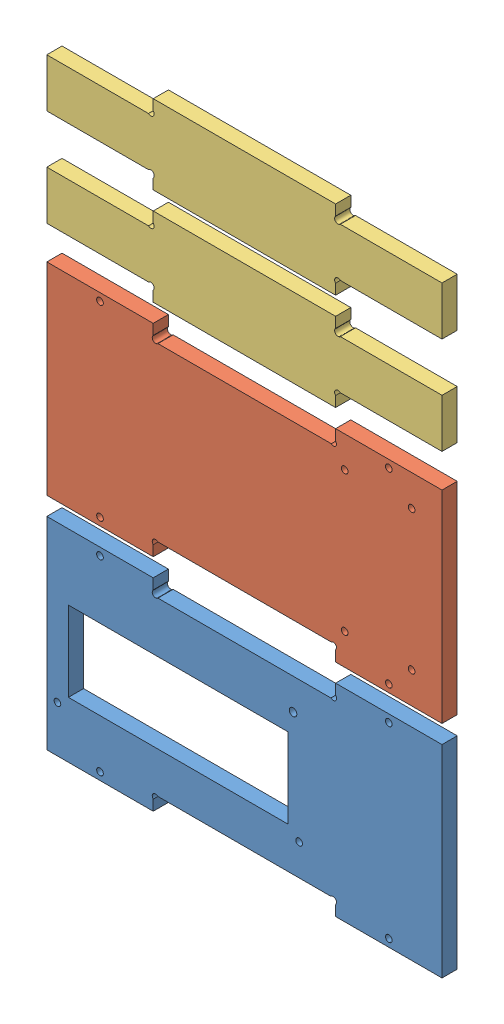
SolidWorks assembly Piece a plat OLED 2 lignes.SLDASM, configuration Défaut (file format 7000). Lengths in mm.
Overall size (130 203 5).
4 component instances, 3 part files, 9 mates.
Components (placement in the parent):
- cache OLED 2 lignes-1: cache OLED 2 lignes.SLDPRT [Défaut] at (-75.354 -21.0194 127.5) size (130 66.5 5)
- support OLED 2 lignes-1: support OLED 2 lignes.SLDPRT [Défaut] at (-75.354 51.4806 127.5) size (130 66.5 5)
- plaque-1: plaque.SLDPRT [Défaut] at (-75.354 123.9806 127.5) size (130 26 5)
- plaque-2: plaque.SLDPRT [Défaut] at (-75.354 155.9806 127.5) size (130 26 5)
Mates (geometry in assembly coordinates):
- Coïncidente1: coincident aligned: plane of cache OLED 2 lignes-1 through (-75.354 45.4806 127.5) normal (0 0 -1); plane of support OLED 2 lignes-1 through (-75.354 117.9806 127.5) normal (0 0 -1)
- Coïncidente2: coincident aligned: plane of support OLED 2 lignes-1 through (-75.354 117.9806 127.5) normal (0 0 -1); plane of plaque-1 through (-75.354 149.9806 127.5) normal (0 0 -1)
- Coïncidente3: coincident aligned: plane of cache OLED 2 lignes-1 through (-75.354 45.4806 127.5) normal (0 0 -1); plane of plaque-2 through (-75.354 181.9806 127.5) normal (0 0 -1)
- Coïncidente4: coincident aligned: plane of cache OLED 2 lignes-1 through (54.646 -21.0194 132.5) normal (1 0 0); plane of support OLED 2 lignes-1 through (54.646 51.4806 132.5) normal (1 0 0)
- Coïncidente5: coincident aligned: plane of cache OLED 2 lignes-1 through (54.646 -21.0194 132.5) normal (1 0 0); plane of plaque-1 through (54.646 123.9806 132.5) normal (1 0 0)
- Coïncidente6: coincident aligned: plane of cache OLED 2 lignes-1 through (54.646 -21.0194 132.5) normal (1 0 0); plane of plaque-2 through (54.646 155.9806 132.5) normal (1 0 0)
- Distance1: distance = 6 mm anti-aligned: plane of cache OLED 2 lignes-1 through (-75.354 45.4806 132.5) normal (0 1 0); plane of support OLED 2 lignes-1 through (-75.354 51.4806 132.5) normal (0 -1 0)
- Distance2: distance = 6 mm anti-aligned: plane of support OLED 2 lignes-1 through (-75.354 117.9806 132.5) normal (0 1 0); plane of plaque-1 through (-75.354 123.9806 132.5) normal (0 -1 0)
- Distance3: distance = 6 mm anti-aligned: plane of plaque-2 through (-75.354 155.9806 132.5) normal (0 -1 0); plane of plaque-1 through (-75.354 149.9806 132.5) normal (0 1 0)
